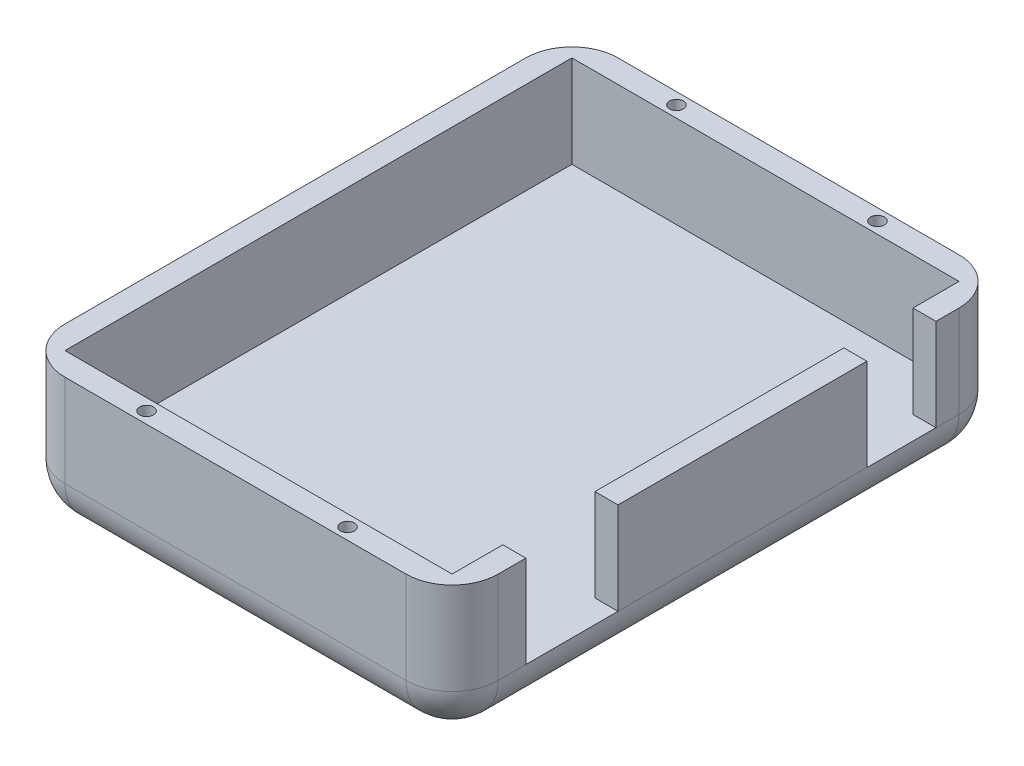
ISO-10303-21;
HEADER;
FILE_DESCRIPTION(('STEP AP214'),'2;1');
FILE_NAME('part.step','',(''),(''),'','','');
FILE_SCHEMA(('AUTOMOTIVE_DESIGN { 1 0 10303 214 1 1 1 1 }'));
ENDSEC;
DATA;
#1=APPLICATION_CONTEXT('core data for automotive mechanical design processes');
#2=APPLICATION_PROTOCOL_DEFINITION('international standard','automotive_design',2000,#1);
#3=PRODUCT_CONTEXT('',#1,'mechanical');
#4=PRODUCT('Part','Part','',(#3));
#5=PRODUCT_RELATED_PRODUCT_CATEGORY('part','',(#4));
#6=PRODUCT_DEFINITION_FORMATION('','',#4);
#7=PRODUCT_DEFINITION_CONTEXT('part definition',#1,'design');
#8=PRODUCT_DEFINITION('design','',#6,#7);
#9=PRODUCT_DEFINITION_SHAPE('','',#8);
#10=(LENGTH_UNIT() NAMED_UNIT(*) SI_UNIT(.MILLI.,.METRE.));
#11=(NAMED_UNIT(*) PLANE_ANGLE_UNIT() SI_UNIT($,.RADIAN.));
#12=(NAMED_UNIT(*) SI_UNIT($,.STERADIAN.) SOLID_ANGLE_UNIT());
#13=UNCERTAINTY_MEASURE_WITH_UNIT(LENGTH_MEASURE(1.E-05),#10,'distance_accuracy_value','');
#14=(GEOMETRIC_REPRESENTATION_CONTEXT(3) GLOBAL_UNCERTAINTY_ASSIGNED_CONTEXT((#13)) GLOBAL_UNIT_ASSIGNED_CONTEXT((#10,
#11,#12)) REPRESENTATION_CONTEXT('',''));
#15=CARTESIAN_POINT('',(0.,0.,0.));
#16=DIRECTION('',(0.,0.,1.));
#17=DIRECTION('',(1.,0.,0.));
#18=AXIS2_PLACEMENT_3D('',#15,#16,#17);
#19=CARTESIAN_POINT('',(0.,30.,120.));
#20=DIRECTION('',(0.,1.,0.));
#21=DIRECTION('',(0.,0.,1.));
#22=AXIS2_PLACEMENT_3D('',#19,#20,#21);
#23=PLANE('',#22);
#24=CARTESIAN_POINT('',(68.8071891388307,30.,117.5));
#25=DIRECTION('',(0.,-1.,0.));
#26=DIRECTION('',(0.,0.,-1.));
#27=AXIS2_PLACEMENT_3D('',#24,#25,#26);
#28=CIRCLE('',#27,1.5);
#29=CARTESIAN_POINT('',(68.8071891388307,30.,116.));
#30=VERTEX_POINT('',#29);
#31=EDGE_CURVE('E947',#30,#30,#28,.T.);
#32=ORIENTED_EDGE('',*,*,#31,.T.);
#33=EDGE_LOOP('',(#32));
#34=FACE_BOUND('',#33,.T.);
#35=CARTESIAN_POINT('',(68.8071891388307,30.,2.50000000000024));
#36=DIRECTION('',(0.,-1.,0.));
#37=DIRECTION('',(0.,0.,-1.));
#38=AXIS2_PLACEMENT_3D('',#35,#36,#37);
#39=CIRCLE('',#38,1.5);
#40=CARTESIAN_POINT('',(68.8071891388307,30.,1.00000000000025));
#41=VERTEX_POINT('',#40);
#42=EDGE_CURVE('E957',#41,#41,#39,.T.);
#43=ORIENTED_EDGE('',*,*,#42,.T.);
#44=EDGE_LOOP('',(#43));
#45=FACE_BOUND('',#44,.T.);
#46=CARTESIAN_POINT('',(25.1928108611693,30.,2.5));
#47=DIRECTION('',(0.,1.,0.));
#48=DIRECTION('',(0.,0.,1.));
#49=AXIS2_PLACEMENT_3D('',#46,#47,#48);
#50=CIRCLE('',#49,1.5);
#51=CARTESIAN_POINT('',(25.1928108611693,30.,4.));
#52=VERTEX_POINT('',#51);
#53=EDGE_CURVE('E950',#52,#52,#50,.T.);
#54=ORIENTED_EDGE('',*,*,#53,.F.);
#55=EDGE_LOOP('',(#54));
#56=FACE_BOUND('',#55,.T.);
#57=DIRECTION('',(0.,0.,-1.));
#58=VECTOR('',#57,1.);
#59=CARTESIAN_POINT('',(0.,30.,120.));
#60=LINE('',#59,#58);
#61=CARTESIAN_POINT('',(0.,30.,110.));
#62=VERTEX_POINT('',#61);
#63=CARTESIAN_POINT('',(0.,30.,9.99999999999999));
#64=VERTEX_POINT('',#63);
#65=EDGE_CURVE('E334',#62,#64,#60,.T.);
#66=ORIENTED_EDGE('',*,*,#65,.F.);
#67=CARTESIAN_POINT('',(10.,30.,110.));
#68=DIRECTION('',(0.,1.,0.));
#69=DIRECTION('',(0.,0.,1.));
#70=AXIS2_PLACEMENT_3D('',#67,#68,#69);
#71=CIRCLE('',#70,10.);
#72=CARTESIAN_POINT('',(10.,30.,120.));
#73=VERTEX_POINT('',#72);
#74=EDGE_CURVE('E361',#62,#73,#71,.T.);
#75=ORIENTED_EDGE('',*,*,#74,.T.);
#76=DIRECTION('',(1.,0.,0.));
#77=VECTOR('',#76,1.);
#78=CARTESIAN_POINT('',(0.,30.,120.));
#79=LINE('',#78,#77);
#80=CARTESIAN_POINT('',(84.,30.,120.));
#81=VERTEX_POINT('',#80);
#82=EDGE_CURVE('E331',#73,#81,#79,.T.);
#83=ORIENTED_EDGE('',*,*,#82,.T.);
#84=CARTESIAN_POINT('',(84.,30.,110.));
#85=DIRECTION('',(0.,1.,0.));
#86=DIRECTION('',(0.,0.,1.));
#87=AXIS2_PLACEMENT_3D('',#84,#85,#86);
#88=CIRCLE('',#87,10.);
#89=CARTESIAN_POINT('',(94.,30.,110.));
#90=VERTEX_POINT('',#89);
#91=EDGE_CURVE('E359',#81,#90,#88,.T.);
#92=ORIENTED_EDGE('',*,*,#91,.T.);
#93=DIRECTION('',(0.,0.,-1.));
#94=VECTOR('',#93,1.);
#95=CARTESIAN_POINT('',(94.,30.,120.));
#96=LINE('',#95,#94);
#97=CARTESIAN_POINT('',(94.,30.,104.));
#98=VERTEX_POINT('',#97);
#99=EDGE_CURVE('E337',#90,#98,#96,.T.);
#100=ORIENTED_EDGE('',*,*,#99,.T.);
#101=DIRECTION('',(1.,0.,0.));
#102=VECTOR('',#101,1.);
#103=CARTESIAN_POINT('',(89.,30.,104.));
#104=LINE('',#103,#102);
#105=CARTESIAN_POINT('',(89.,30.,104.));
#106=VERTEX_POINT('',#105);
#107=EDGE_CURVE('E271',#106,#98,#104,.T.);
#108=ORIENTED_EDGE('',*,*,#107,.F.);
#109=DIRECTION('',(0.,0.,-1.));
#110=VECTOR('',#109,1.);
#111=CARTESIAN_POINT('',(89.,30.,115.));
#112=LINE('',#111,#110);
#113=CARTESIAN_POINT('',(89.,30.,115.));
#114=VERTEX_POINT('',#113);
#115=EDGE_CURVE('E314',#114,#106,#112,.T.);
#116=ORIENTED_EDGE('',*,*,#115,.F.);
#117=DIRECTION('',(1.,0.,0.));
#118=VECTOR('',#117,1.);
#119=CARTESIAN_POINT('',(5.,30.,115.));
#120=LINE('',#119,#118);
#121=CARTESIAN_POINT('',(5.,30.,115.));
#122=VERTEX_POINT('',#121);
#123=EDGE_CURVE('E296',#122,#114,#120,.T.);
#124=ORIENTED_EDGE('',*,*,#123,.F.);
#125=DIRECTION('',(0.,0.,-1.));
#126=VECTOR('',#125,1.);
#127=CARTESIAN_POINT('',(5.,30.,115.));
#128=LINE('',#127,#126);
#129=CARTESIAN_POINT('',(4.99999999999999,30.,5.));
#130=VERTEX_POINT('',#129);
#131=EDGE_CURVE('E291',#122,#130,#128,.T.);
#132=ORIENTED_EDGE('',*,*,#131,.T.);
#133=DIRECTION('',(1.,0.,0.));
#134=VECTOR('',#133,1.);
#135=CARTESIAN_POINT('',(4.99999999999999,30.,5.));
#136=LINE('',#135,#134);
#137=CARTESIAN_POINT('',(89.,30.,5.));
#138=VERTEX_POINT('',#137);
#139=EDGE_CURVE('E310',#130,#138,#136,.T.);
#140=ORIENTED_EDGE('',*,*,#139,.T.);
#141=CARTESIAN_POINT('',(89.,30.,15.));
#142=VERTEX_POINT('',#141);
#143=EDGE_CURVE('E313',#142,#138,#112,.T.);
#144=ORIENTED_EDGE('',*,*,#143,.F.);
#145=DIRECTION('',(-1.,0.,0.));
#146=VECTOR('',#145,1.);
#147=CARTESIAN_POINT('',(89.,30.,15.));
#148=LINE('',#147,#146);
#149=CARTESIAN_POINT('',(94.,30.,15.));
#150=VERTEX_POINT('',#149);
#151=EDGE_CURVE('E248',#150,#142,#148,.T.);
#152=ORIENTED_EDGE('',*,*,#151,.F.);
#153=CARTESIAN_POINT('',(94.,30.,9.99999999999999));
#154=VERTEX_POINT('',#153);
#155=EDGE_CURVE('E341',#150,#154,#96,.T.);
#156=ORIENTED_EDGE('',*,*,#155,.T.);
#157=CARTESIAN_POINT('',(84.,30.,10.));
#158=DIRECTION('',(0.,1.,0.));
#159=DIRECTION('',(0.,0.,1.));
#160=AXIS2_PLACEMENT_3D('',#157,#158,#159);
#161=CIRCLE('',#160,10.);
#162=CARTESIAN_POINT('',(84.,30.,0.));
#163=VERTEX_POINT('',#162);
#164=EDGE_CURVE('E357',#154,#163,#161,.T.);
#165=ORIENTED_EDGE('',*,*,#164,.T.);
#166=DIRECTION('',(1.,0.,0.));
#167=VECTOR('',#166,1.);
#168=CARTESIAN_POINT('',(0.,30.,0.));
#169=LINE('',#168,#167);
#170=CARTESIAN_POINT('',(10.,30.,0.));
#171=VERTEX_POINT('',#170);
#172=EDGE_CURVE('E330',#171,#163,#169,.T.);
#173=ORIENTED_EDGE('',*,*,#172,.F.);
#174=CARTESIAN_POINT('',(10.,30.,10.));
#175=DIRECTION('',(0.,1.,0.));
#176=DIRECTION('',(0.,0.,1.));
#177=AXIS2_PLACEMENT_3D('',#174,#175,#176);
#178=CIRCLE('',#177,10.);
#179=EDGE_CURVE('E349',#171,#64,#178,.T.);
#180=ORIENTED_EDGE('',*,*,#179,.T.);
#181=EDGE_LOOP('',(#66,#75,#83,#92,#100,#108,#116,#124,#132,#140,#144,#152,#156,#165,#173,#180));
#182=FACE_BOUND('',#181,.T.);
#183=CARTESIAN_POINT('',(25.1928108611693,30.,117.5));
#184=DIRECTION('',(0.,1.,0.));
#185=DIRECTION('',(0.,0.,1.));
#186=AXIS2_PLACEMENT_3D('',#183,#184,#185);
#187=CIRCLE('',#186,1.5);
#188=CARTESIAN_POINT('',(25.1928108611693,30.,119.));
#189=VERTEX_POINT('',#188);
#190=EDGE_CURVE('E946',#189,#189,#187,.T.);
#191=ORIENTED_EDGE('',*,*,#190,.F.);
#192=EDGE_LOOP('',(#191));
#193=FACE_BOUND('',#192,.T.);
#194=ADVANCED_FACE('F35',(#34,#45,#56,#182,#193),#23,.T.);
#195=CARTESIAN_POINT('',(94.,30.,120.));
#196=DIRECTION('',(1.,0.,0.));
#197=DIRECTION('',(0.,0.,-1.));
#198=AXIS2_PLACEMENT_3D('',#195,#196,#197);
#199=PLANE('',#198);
#200=DIRECTION('',(0.,-1.,0.));
#201=VECTOR('',#200,1.);
#202=CARTESIAN_POINT('',(94.,0.,110.));
#203=LINE('',#202,#201);
#204=CARTESIAN_POINT('',(94.,10.,110.));
#205=VERTEX_POINT('',#204);
#206=EDGE_CURVE('E370',#90,#205,#203,.T.);
#207=ORIENTED_EDGE('',*,*,#206,.T.);
#208=DIRECTION('',(0.,0.,-1.));
#209=VECTOR('',#208,1.);
#210=CARTESIAN_POINT('',(94.,10.,9.99999999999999));
#211=LINE('',#210,#209);
#212=CARTESIAN_POINT('',(94.,10.,104.));
#213=VERTEX_POINT('',#212);
#214=EDGE_CURVE('E398',#205,#213,#211,.T.);
#215=ORIENTED_EDGE('',*,*,#214,.T.);
#216=DIRECTION('',(0.,-1.,0.));
#217=VECTOR('',#216,1.);
#218=CARTESIAN_POINT('',(94.,30.,104.));
#219=LINE('',#218,#217);
#220=EDGE_CURVE('E285',#98,#213,#219,.T.);
#221=ORIENTED_EDGE('',*,*,#220,.F.);
#222=ORIENTED_EDGE('',*,*,#99,.F.);
#223=EDGE_LOOP('',(#207,#215,#221,#222));
#224=FACE_BOUND('',#223,.T.);
#225=ADVANCED_FACE('F439',(#224),#199,.T.);
#226=DIRECTION('',(0.,-1.,0.));
#227=VECTOR('',#226,1.);
#228=CARTESIAN_POINT('',(94.,30.,84.));
#229=LINE('',#228,#227);
#230=CARTESIAN_POINT('',(94.,30.,84.));
#231=VERTEX_POINT('',#230);
#232=CARTESIAN_POINT('',(94.,10.,84.));
#233=VERTEX_POINT('',#232);
#234=EDGE_CURVE('E288',#231,#233,#229,.T.);
#235=ORIENTED_EDGE('',*,*,#234,.T.);
#236=DIRECTION('',(0.,0.,-1.));
#237=VECTOR('',#236,1.);
#238=CARTESIAN_POINT('',(94.,10.,9.99999999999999));
#239=LINE('',#238,#237);
#240=CARTESIAN_POINT('',(94.,10.,30.));
#241=VERTEX_POINT('',#240);
#242=EDGE_CURVE('E396',#233,#241,#239,.T.);
#243=ORIENTED_EDGE('',*,*,#242,.T.);
#244=DIRECTION('',(0.,-1.,0.));
#245=VECTOR('',#244,1.);
#246=CARTESIAN_POINT('',(94.,30.,30.));
#247=LINE('',#246,#245);
#248=CARTESIAN_POINT('',(94.,30.,30.));
#249=VERTEX_POINT('',#248);
#250=EDGE_CURVE('E257',#249,#241,#247,.T.);
#251=ORIENTED_EDGE('',*,*,#250,.F.);
#252=EDGE_CURVE('E340',#231,#249,#96,.T.);
#253=ORIENTED_EDGE('',*,*,#252,.F.);
#254=EDGE_LOOP('',(#235,#243,#251,#253));
#255=FACE_BOUND('',#254,.T.);
#256=ADVANCED_FACE('F487',(#255),#199,.T.);
#257=CARTESIAN_POINT('',(34.,-26.,42.8830656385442));
#258=DIRECTION('',(-1.,0.,0.));
#259=DIRECTION('',(0.,0.,1.));
#260=AXIS2_PLACEMENT_3D('',#257,#258,#259);
#261=PLANE('',#260);
#262=DIRECTION('',(0.,1.,0.));
#263=VECTOR('',#262,1.);
#264=CARTESIAN_POINT('',(34.,-26.,42.8830656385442));
#265=LINE('',#264,#263);
#266=CARTESIAN_POINT('',(34.,-13.,42.8830656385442));
#267=VERTEX_POINT('',#266);
#268=CARTESIAN_POINT('',(34.,0.,42.8830656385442));
#269=VERTEX_POINT('',#268);
#270=EDGE_CURVE('E227',#267,#269,#265,.T.);
#271=ORIENTED_EDGE('',*,*,#270,.F.);
#272=DIRECTION('',(0.,0.,-1.));
#273=VECTOR('',#272,1.);
#274=CARTESIAN_POINT('',(34.,-13.,120.));
#275=LINE('',#274,#273);
#276=CARTESIAN_POINT('',(34.,-13.,76.8830656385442));
#277=VERTEX_POINT('',#276);
#278=EDGE_CURVE('E213',#277,#267,#275,.T.);
#279=ORIENTED_EDGE('',*,*,#278,.F.);
#280=DIRECTION('',(0.,1.,0.));
#281=VECTOR('',#280,1.);
#282=CARTESIAN_POINT('',(34.,-26.,76.8830656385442));
#283=LINE('',#282,#281);
#284=CARTESIAN_POINT('',(34.,0.,76.8830656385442));
#285=VERTEX_POINT('',#284);
#286=EDGE_CURVE('E225',#277,#285,#283,.T.);
#287=ORIENTED_EDGE('',*,*,#286,.T.);
#288=DIRECTION('',(0.,0.,1.));
#289=VECTOR('',#288,1.);
#290=CARTESIAN_POINT('',(34.,0.,42.8830656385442));
#291=LINE('',#290,#289);
#292=EDGE_CURVE('E238',#269,#285,#291,.T.);
#293=ORIENTED_EDGE('',*,*,#292,.F.);
#294=EDGE_LOOP('',(#271,#279,#287,#293));
#295=FACE_BOUND('',#294,.T.);
#296=ADVANCED_FACE('F223',(#295),#261,.T.);
#297=CARTESIAN_POINT('',(0.,0.,120.));
#298=DIRECTION('',(0.,1.,0.));
#299=DIRECTION('',(0.,0.,1.));
#300=AXIS2_PLACEMENT_3D('',#297,#298,#299);
#301=PLANE('',#300);
#302=DIRECTION('',(1.,0.,0.));
#303=VECTOR('',#302,1.);
#304=CARTESIAN_POINT('',(0.,0.,110.));
#305=LINE('',#304,#303);
#306=CARTESIAN_POINT('',(84.,0.,110.));
#307=VERTEX_POINT('',#306);
#308=CARTESIAN_POINT('',(10.,0.,110.));
#309=VERTEX_POINT('',#308);
#310=EDGE_CURVE('E382',#307,#309,#305,.F.);
#311=ORIENTED_EDGE('',*,*,#310,.T.);
#312=DIRECTION('',(0.,0.,-1.));
#313=VECTOR('',#312,1.);
#314=CARTESIAN_POINT('',(10.,0.,9.99999999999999));
#315=LINE('',#314,#313);
#316=CARTESIAN_POINT('',(10.,0.,9.99999999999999));
#317=VERTEX_POINT('',#316);
#318=EDGE_CURVE('E384',#309,#317,#315,.T.);
#319=ORIENTED_EDGE('',*,*,#318,.T.);
#320=DIRECTION('',(1.,0.,0.));
#321=VECTOR('',#320,1.);
#322=CARTESIAN_POINT('',(84.,0.,9.99999999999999));
#323=LINE('',#322,#321);
#324=CARTESIAN_POINT('',(84.,0.,9.99999999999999));
#325=VERTEX_POINT('',#324);
#326=EDGE_CURVE('E378',#317,#325,#323,.T.);
#327=ORIENTED_EDGE('',*,*,#326,.T.);
#328=DIRECTION('',(0.,0.,-1.));
#329=VECTOR('',#328,1.);
#330=CARTESIAN_POINT('',(84.,0.,110.));
#331=LINE('',#330,#329);
#332=EDGE_CURVE('E380',#325,#307,#331,.F.);
#333=ORIENTED_EDGE('',*,*,#332,.T.);
#334=EDGE_LOOP('',(#311,#319,#327,#333));
#335=FACE_BOUND('',#334,.T.);
#336=DIRECTION('',(1.,0.,0.));
#337=VECTOR('',#336,1.);
#338=CARTESIAN_POINT('',(34.,0.,42.8830656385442));
#339=LINE('',#338,#337);
#340=CARTESIAN_POINT('',(60.,0.,42.8830656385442));
#341=VERTEX_POINT('',#340);
#342=EDGE_CURVE('E346',#269,#341,#339,.T.);
#343=ORIENTED_EDGE('',*,*,#342,.F.);
#344=ORIENTED_EDGE('',*,*,#292,.T.);
#345=DIRECTION('',(1.,0.,0.));
#346=VECTOR('',#345,1.);
#347=CARTESIAN_POINT('',(34.,0.,76.8830656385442));
#348=LINE('',#347,#346);
#349=CARTESIAN_POINT('',(60.,0.,76.8830656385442));
#350=VERTEX_POINT('',#349);
#351=EDGE_CURVE('E232',#285,#350,#348,.T.);
#352=ORIENTED_EDGE('',*,*,#351,.T.);
#353=DIRECTION('',(0.,0.,-1.));
#354=VECTOR('',#353,1.);
#355=CARTESIAN_POINT('',(60.,0.,76.8830656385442));
#356=LINE('',#355,#354);
#357=EDGE_CURVE('E973',#350,#341,#356,.T.);
#358=ORIENTED_EDGE('',*,*,#357,.T.);
#359=EDGE_LOOP('',(#343,#344,#352,#358));
#360=FACE_BOUND('',#359,.T.);
#361=ADVANCED_FACE('F560',(#335,#360),#301,.F.);
#362=CARTESIAN_POINT('',(89.,10.,115.));
#363=DIRECTION('',(1.,0.,0.));
#364=DIRECTION('',(0.,0.,-1.));
#365=AXIS2_PLACEMENT_3D('',#362,#363,#364);
#366=PLANE('',#365);
#367=DIRECTION('',(0.,0.,-1.));
#368=VECTOR('',#367,1.);
#369=CARTESIAN_POINT('',(89.,10.,115.));
#370=LINE('',#369,#368);
#371=CARTESIAN_POINT('',(89.,10.,15.));
#372=VERTEX_POINT('',#371);
#373=CARTESIAN_POINT('',(89.,10.,5.));
#374=VERTEX_POINT('',#373);
#375=EDGE_CURVE('E299',#372,#374,#370,.T.);
#376=ORIENTED_EDGE('',*,*,#375,.F.);
#377=DIRECTION('',(0.,1.,0.));
#378=VECTOR('',#377,1.);
#379=CARTESIAN_POINT('',(89.,10.,15.));
#380=LINE('',#379,#378);
#381=EDGE_CURVE('E254',#372,#142,#380,.T.);
#382=ORIENTED_EDGE('',*,*,#381,.T.);
#383=ORIENTED_EDGE('',*,*,#143,.T.);
#384=DIRECTION('',(0.,1.,0.));
#385=VECTOR('',#384,1.);
#386=CARTESIAN_POINT('',(89.,10.,5.));
#387=LINE('',#386,#385);
#388=EDGE_CURVE('E324',#374,#138,#387,.T.);
#389=ORIENTED_EDGE('',*,*,#388,.F.);
#390=EDGE_LOOP('',(#376,#382,#383,#389));
#391=FACE_BOUND('',#390,.T.);
#392=ADVANCED_FACE('F469',(#391),#366,.F.);
#393=DIRECTION('',(1.,0.,0.));
#394=VECTOR('',#393,1.);
#395=CARTESIAN_POINT('',(89.,30.,30.));
#396=LINE('',#395,#394);
#397=CARTESIAN_POINT('',(89.,30.,30.));
#398=VERTEX_POINT('',#397);
#399=EDGE_CURVE('E243',#398,#249,#396,.T.);
#400=ORIENTED_EDGE('',*,*,#399,.F.);
#401=CARTESIAN_POINT('',(89.,30.,84.));
#402=VERTEX_POINT('',#401);
#403=EDGE_CURVE('E317',#402,#398,#112,.T.);
#404=ORIENTED_EDGE('',*,*,#403,.F.);
#405=DIRECTION('',(1.,0.,0.));
#406=VECTOR('',#405,1.);
#407=CARTESIAN_POINT('',(89.,30.,84.));
#408=LINE('',#407,#406);
#409=EDGE_CURVE('E266',#402,#231,#408,.T.);
#410=ORIENTED_EDGE('',*,*,#409,.T.);
#411=ORIENTED_EDGE('',*,*,#252,.T.);
#412=EDGE_LOOP('',(#400,#404,#410,#411));
#413=FACE_BOUND('',#412,.T.);
#414=ADVANCED_FACE('F480',(#413),#23,.T.);
#415=DIRECTION('',(0.,1.,0.));
#416=VECTOR('',#415,1.);
#417=CARTESIAN_POINT('',(94.,30.,15.));
#418=LINE('',#417,#416);
#419=CARTESIAN_POINT('',(94.,10.,15.));
#420=VERTEX_POINT('',#419);
#421=EDGE_CURVE('E261',#420,#150,#418,.T.);
#422=ORIENTED_EDGE('',*,*,#421,.F.);
#423=DIRECTION('',(0.,0.,-1.));
#424=VECTOR('',#423,1.);
#425=CARTESIAN_POINT('',(94.,10.,9.99999999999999));
#426=LINE('',#425,#424);
#427=CARTESIAN_POINT('',(94.,10.,9.99999999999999));
#428=VERTEX_POINT('',#427);
#429=EDGE_CURVE('E59',#420,#428,#426,.T.);
#430=ORIENTED_EDGE('',*,*,#429,.T.);
#431=DIRECTION('',(0.,-1.,0.));
#432=VECTOR('',#431,1.);
#433=CARTESIAN_POINT('',(94.,30.,9.99999999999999));
#434=LINE('',#433,#432);
#435=EDGE_CURVE('E368',#428,#154,#434,.F.);
#436=ORIENTED_EDGE('',*,*,#435,.T.);
#437=ORIENTED_EDGE('',*,*,#155,.F.);
#438=EDGE_LOOP('',(#422,#430,#436,#437));
#439=FACE_BOUND('',#438,.T.);
#440=ADVANCED_FACE('F495',(#439),#199,.T.);
#441=ORIENTED_EDGE('',*,*,#403,.T.);
#442=DIRECTION('',(0.,1.,0.));
#443=VECTOR('',#442,1.);
#444=CARTESIAN_POINT('',(89.,10.,30.));
#445=LINE('',#444,#443);
#446=CARTESIAN_POINT('',(89.,10.,30.));
#447=VERTEX_POINT('',#446);
#448=EDGE_CURVE('E251',#447,#398,#445,.T.);
#449=ORIENTED_EDGE('',*,*,#448,.F.);
#450=CARTESIAN_POINT('',(89.,10.,84.));
#451=VERTEX_POINT('',#450);
#452=EDGE_CURVE('E304',#451,#447,#370,.T.);
#453=ORIENTED_EDGE('',*,*,#452,.F.);
#454=DIRECTION('',(0.,1.,0.));
#455=VECTOR('',#454,1.);
#456=CARTESIAN_POINT('',(89.,10.,84.));
#457=LINE('',#456,#455);
#458=EDGE_CURVE('E280',#451,#402,#457,.T.);
#459=ORIENTED_EDGE('',*,*,#458,.T.);
#460=EDGE_LOOP('',(#441,#449,#453,#459));
#461=FACE_BOUND('',#460,.T.);
#462=ADVANCED_FACE('F475',(#461),#366,.F.);
#463=CARTESIAN_POINT('',(0.,0.,120.));
#464=DIRECTION('',(-1.,0.,0.));
#465=DIRECTION('',(0.,0.,1.));
#466=AXIS2_PLACEMENT_3D('',#463,#464,#465);
#467=PLANE('',#466);
#468=DIRECTION('',(0.,1.,0.));
#469=VECTOR('',#468,1.);
#470=CARTESIAN_POINT('',(0.,0.,9.99999999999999));
#471=LINE('',#470,#469);
#472=CARTESIAN_POINT('',(0.,10.,9.99999999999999));
#473=VERTEX_POINT('',#472);
#474=EDGE_CURVE('E352',#64,#473,#471,.F.);
#475=ORIENTED_EDGE('',*,*,#474,.T.);
#476=DIRECTION('',(0.,0.,-1.));
#477=VECTOR('',#476,1.);
#478=CARTESIAN_POINT('',(0.,10.,110.));
#479=LINE('',#478,#477);
#480=CARTESIAN_POINT('',(0.,10.,110.));
#481=VERTEX_POINT('',#480);
#482=EDGE_CURVE('E387',#473,#481,#479,.F.);
#483=ORIENTED_EDGE('',*,*,#482,.T.);
#484=DIRECTION('',(0.,1.,0.));
#485=VECTOR('',#484,1.);
#486=CARTESIAN_POINT('',(0.,30.,110.));
#487=LINE('',#486,#485);
#488=EDGE_CURVE('E355',#481,#62,#487,.T.);
#489=ORIENTED_EDGE('',*,*,#488,.T.);
#490=ORIENTED_EDGE('',*,*,#65,.T.);
#491=EDGE_LOOP('',(#475,#483,#489,#490));
#492=FACE_BOUND('',#491,.T.);
#493=ADVANCED_FACE('F526',(#492),#467,.T.);
#494=CARTESIAN_POINT('',(0.,0.,120.));
#495=DIRECTION('',(0.,0.,-1.));
#496=DIRECTION('',(-1.,0.,0.));
#497=AXIS2_PLACEMENT_3D('',#494,#495,#496);
#498=PLANE('',#497);
#499=DIRECTION('',(0.,1.,0.));
#500=VECTOR('',#499,1.);
#501=CARTESIAN_POINT('',(10.,0.,120.));
#502=LINE('',#501,#500);
#503=CARTESIAN_POINT('',(10.,10.,120.));
#504=VERTEX_POINT('',#503);
#505=EDGE_CURVE('E365',#73,#504,#502,.F.);
#506=ORIENTED_EDGE('',*,*,#505,.T.);
#507=DIRECTION('',(1.,0.,0.));
#508=VECTOR('',#507,1.);
#509=CARTESIAN_POINT('',(0.,10.,120.));
#510=LINE('',#509,#508);
#511=CARTESIAN_POINT('',(84.,10.,120.));
#512=VERTEX_POINT('',#511);
#513=EDGE_CURVE('E391',#504,#512,#510,.T.);
#514=ORIENTED_EDGE('',*,*,#513,.T.);
#515=DIRECTION('',(0.,-1.,0.));
#516=VECTOR('',#515,1.);
#517=CARTESIAN_POINT('',(84.,30.,120.));
#518=LINE('',#517,#516);
#519=EDGE_CURVE('E363',#512,#81,#518,.F.);
#520=ORIENTED_EDGE('',*,*,#519,.T.);
#521=ORIENTED_EDGE('',*,*,#82,.F.);
#522=EDGE_LOOP('',(#506,#514,#520,#521));
#523=FACE_BOUND('',#522,.T.);
#524=ADVANCED_FACE('F532',(#523),#498,.F.);
#525=CARTESIAN_POINT('',(0.,0.,0.));
#526=DIRECTION('',(0.,0.,-1.));
#527=DIRECTION('',(-1.,0.,0.));
#528=AXIS2_PLACEMENT_3D('',#525,#526,#527);
#529=PLANE('',#528);
#530=DIRECTION('',(0.,-1.,0.));
#531=VECTOR('',#530,1.);
#532=CARTESIAN_POINT('',(84.,0.,0.));
#533=LINE('',#532,#531);
#534=CARTESIAN_POINT('',(84.,10.,0.));
#535=VERTEX_POINT('',#534);
#536=EDGE_CURVE('E373',#163,#535,#533,.T.);
#537=ORIENTED_EDGE('',*,*,#536,.T.);
#538=DIRECTION('',(1.,0.,0.));
#539=VECTOR('',#538,1.);
#540=CARTESIAN_POINT('',(10.,10.,0.));
#541=LINE('',#540,#539);
#542=CARTESIAN_POINT('',(10.,10.,0.));
#543=VERTEX_POINT('',#542);
#544=EDGE_CURVE('E11',#535,#543,#541,.F.);
#545=ORIENTED_EDGE('',*,*,#544,.T.);
#546=DIRECTION('',(0.,1.,0.));
#547=VECTOR('',#546,1.);
#548=CARTESIAN_POINT('',(10.,0.,0.));
#549=LINE('',#548,#547);
#550=EDGE_CURVE('E339',#543,#171,#549,.T.);
#551=ORIENTED_EDGE('',*,*,#550,.T.);
#552=ORIENTED_EDGE('',*,*,#172,.T.);
#553=EDGE_LOOP('',(#537,#545,#551,#552));
#554=FACE_BOUND('',#553,.T.);
#555=ADVANCED_FACE('F502',(#554),#529,.T.);
#556=CARTESIAN_POINT('',(5.,10.,115.));
#557=DIRECTION('',(1.,0.,0.));
#558=DIRECTION('',(0.,0.,-1.));
#559=AXIS2_PLACEMENT_3D('',#556,#557,#558);
#560=PLANE('',#559);
#561=ORIENTED_EDGE('',*,*,#131,.F.);
#562=DIRECTION('',(0.,1.,0.));
#563=VECTOR('',#562,1.);
#564=CARTESIAN_POINT('',(5.,10.,115.));
#565=LINE('',#564,#563);
#566=CARTESIAN_POINT('',(5.,10.,115.));
#567=VERTEX_POINT('',#566);
#568=EDGE_CURVE('E307',#567,#122,#565,.T.);
#569=ORIENTED_EDGE('',*,*,#568,.F.);
#570=DIRECTION('',(0.,0.,-1.));
#571=VECTOR('',#570,1.);
#572=CARTESIAN_POINT('',(5.,10.,115.));
#573=LINE('',#572,#571);
#574=CARTESIAN_POINT('',(4.99999999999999,10.,5.));
#575=VERTEX_POINT('',#574);
#576=EDGE_CURVE('E292',#567,#575,#573,.T.);
#577=ORIENTED_EDGE('',*,*,#576,.T.);
#578=DIRECTION('',(0.,1.,0.));
#579=VECTOR('',#578,1.);
#580=CARTESIAN_POINT('',(4.99999999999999,10.,5.));
#581=LINE('',#580,#579);
#582=EDGE_CURVE('E327',#575,#130,#581,.T.);
#583=ORIENTED_EDGE('',*,*,#582,.T.);
#584=EDGE_LOOP('',(#561,#569,#577,#583));
#585=FACE_BOUND('',#584,.T.);
#586=ADVANCED_FACE('F462',(#585),#560,.T.);
#587=CARTESIAN_POINT('',(4.99999999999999,10.,5.));
#588=DIRECTION('',(0.,0.,1.));
#589=DIRECTION('',(1.,0.,0.));
#590=AXIS2_PLACEMENT_3D('',#587,#588,#589);
#591=PLANE('',#590);
#592=ORIENTED_EDGE('',*,*,#139,.F.);
#593=ORIENTED_EDGE('',*,*,#582,.F.);
#594=DIRECTION('',(1.,0.,0.));
#595=VECTOR('',#594,1.);
#596=CARTESIAN_POINT('',(4.99999999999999,10.,5.));
#597=LINE('',#596,#595);
#598=EDGE_CURVE('E295',#575,#374,#597,.T.);
#599=ORIENTED_EDGE('',*,*,#598,.T.);
#600=ORIENTED_EDGE('',*,*,#388,.T.);
#601=EDGE_LOOP('',(#592,#593,#599,#600));
#602=FACE_BOUND('',#601,.T.);
#603=ADVANCED_FACE('F465',(#602),#591,.T.);
#604=ORIENTED_EDGE('',*,*,#115,.T.);
#605=DIRECTION('',(0.,1.,0.));
#606=VECTOR('',#605,1.);
#607=CARTESIAN_POINT('',(89.,10.,104.));
#608=LINE('',#607,#606);
#609=CARTESIAN_POINT('',(89.,10.,104.));
#610=VERTEX_POINT('',#609);
#611=EDGE_CURVE('E274',#610,#106,#608,.T.);
#612=ORIENTED_EDGE('',*,*,#611,.F.);
#613=CARTESIAN_POINT('',(89.,10.,115.));
#614=VERTEX_POINT('',#613);
#615=EDGE_CURVE('E300',#614,#610,#370,.T.);
#616=ORIENTED_EDGE('',*,*,#615,.F.);
#617=DIRECTION('',(0.,1.,0.));
#618=VECTOR('',#617,1.);
#619=CARTESIAN_POINT('',(89.,10.,115.));
#620=LINE('',#619,#618);
#621=EDGE_CURVE('E322',#614,#114,#620,.T.);
#622=ORIENTED_EDGE('',*,*,#621,.T.);
#623=EDGE_LOOP('',(#604,#612,#616,#622));
#624=FACE_BOUND('',#623,.T.);
#625=ADVANCED_FACE('F451',(#624),#366,.F.);
#626=CARTESIAN_POINT('',(5.,10.,115.));
#627=DIRECTION('',(0.,0.,1.));
#628=DIRECTION('',(1.,0.,0.));
#629=AXIS2_PLACEMENT_3D('',#626,#627,#628);
#630=PLANE('',#629);
#631=ORIENTED_EDGE('',*,*,#123,.T.);
#632=ORIENTED_EDGE('',*,*,#621,.F.);
#633=DIRECTION('',(1.,0.,0.));
#634=VECTOR('',#633,1.);
#635=CARTESIAN_POINT('',(5.,10.,115.));
#636=LINE('',#635,#634);
#637=EDGE_CURVE('E303',#567,#614,#636,.T.);
#638=ORIENTED_EDGE('',*,*,#637,.F.);
#639=ORIENTED_EDGE('',*,*,#568,.T.);
#640=EDGE_LOOP('',(#631,#632,#638,#639));
#641=FACE_BOUND('',#640,.T.);
#642=ADVANCED_FACE('F458',(#641),#630,.F.);
#643=CARTESIAN_POINT('',(0.,10.,0.));
#644=DIRECTION('',(0.,-1.,0.));
#645=DIRECTION('',(0.,0.,-1.));
#646=AXIS2_PLACEMENT_3D('',#643,#644,#645);
#647=PLANE('',#646);
#648=ORIENTED_EDGE('',*,*,#576,.F.);
#649=ORIENTED_EDGE('',*,*,#637,.T.);
#650=ORIENTED_EDGE('',*,*,#615,.T.);
#651=DIRECTION('',(1.,0.,0.));
#652=VECTOR('',#651,1.);
#653=CARTESIAN_POINT('',(89.,10.,104.));
#654=LINE('',#653,#652);
#655=EDGE_CURVE('E270',#610,#213,#654,.T.);
#656=ORIENTED_EDGE('',*,*,#655,.T.);
#657=DIRECTION('',(0.,0.,-1.));
#658=VECTOR('',#657,1.);
#659=CARTESIAN_POINT('',(94.,10.,120.));
#660=LINE('',#659,#658);
#661=EDGE_CURVE('E283',#213,#233,#660,.T.);
#662=ORIENTED_EDGE('',*,*,#661,.T.);
#663=DIRECTION('',(1.,0.,0.));
#664=VECTOR('',#663,1.);
#665=CARTESIAN_POINT('',(89.,10.,84.));
#666=LINE('',#665,#664);
#667=EDGE_CURVE('E267',#451,#233,#666,.T.);
#668=ORIENTED_EDGE('',*,*,#667,.F.);
#669=ORIENTED_EDGE('',*,*,#452,.T.);
#670=DIRECTION('',(1.,0.,0.));
#671=VECTOR('',#670,1.);
#672=CARTESIAN_POINT('',(89.,10.,30.));
#673=LINE('',#672,#671);
#674=EDGE_CURVE('E244',#447,#241,#673,.T.);
#675=ORIENTED_EDGE('',*,*,#674,.T.);
#676=DIRECTION('',(0.,0.,1.));
#677=VECTOR('',#676,1.);
#678=CARTESIAN_POINT('',(94.,10.,120.));
#679=LINE('',#678,#677);
#680=EDGE_CURVE('E263',#420,#241,#679,.T.);
#681=ORIENTED_EDGE('',*,*,#680,.F.);
#682=DIRECTION('',(-1.,0.,0.));
#683=VECTOR('',#682,1.);
#684=CARTESIAN_POINT('',(89.,10.,15.));
#685=LINE('',#684,#683);
#686=EDGE_CURVE('E247',#420,#372,#685,.T.);
#687=ORIENTED_EDGE('',*,*,#686,.T.);
#688=ORIENTED_EDGE('',*,*,#375,.T.);
#689=ORIENTED_EDGE('',*,*,#598,.F.);
#690=EDGE_LOOP('',(#648,#649,#650,#656,#662,#668,#669,#675,#681,#687,#688,#689));
#691=FACE_BOUND('',#690,.T.);
#692=ADVANCED_FACE('F454',(#691),#647,.F.);
#693=CARTESIAN_POINT('',(89.,10.,84.));
#694=DIRECTION('',(0.,0.,1.));
#695=DIRECTION('',(1.,0.,0.));
#696=AXIS2_PLACEMENT_3D('',#693,#694,#695);
#697=PLANE('',#696);
#698=ORIENTED_EDGE('',*,*,#409,.F.);
#699=ORIENTED_EDGE('',*,*,#458,.F.);
#700=ORIENTED_EDGE('',*,*,#667,.T.);
#701=ORIENTED_EDGE('',*,*,#234,.F.);
#702=EDGE_LOOP('',(#698,#699,#700,#701));
#703=FACE_BOUND('',#702,.T.);
#704=ADVANCED_FACE('F918',(#703),#697,.T.);
#705=CARTESIAN_POINT('',(89.,10.,104.));
#706=DIRECTION('',(0.,0.,1.));
#707=DIRECTION('',(1.,0.,0.));
#708=AXIS2_PLACEMENT_3D('',#705,#706,#707);
#709=PLANE('',#708);
#710=ORIENTED_EDGE('',*,*,#220,.T.);
#711=ORIENTED_EDGE('',*,*,#655,.F.);
#712=ORIENTED_EDGE('',*,*,#611,.T.);
#713=ORIENTED_EDGE('',*,*,#107,.T.);
#714=EDGE_LOOP('',(#710,#711,#712,#713));
#715=FACE_BOUND('',#714,.T.);
#716=ADVANCED_FACE('F447',(#715),#709,.F.);
#717=CARTESIAN_POINT('',(89.,10.,15.));
#718=DIRECTION('',(0.,0.,-1.));
#719=DIRECTION('',(-1.,0.,0.));
#720=AXIS2_PLACEMENT_3D('',#717,#718,#719);
#721=PLANE('',#720);
#722=ORIENTED_EDGE('',*,*,#421,.T.);
#723=ORIENTED_EDGE('',*,*,#151,.T.);
#724=ORIENTED_EDGE('',*,*,#381,.F.);
#725=ORIENTED_EDGE('',*,*,#686,.F.);
#726=EDGE_LOOP('',(#722,#723,#724,#725));
#727=FACE_BOUND('',#726,.T.);
#728=ADVANCED_FACE('F493',(#727),#721,.F.);
#729=CARTESIAN_POINT('',(89.,10.,30.));
#730=DIRECTION('',(0.,0.,1.));
#731=DIRECTION('',(1.,0.,0.));
#732=AXIS2_PLACEMENT_3D('',#729,#730,#731);
#733=PLANE('',#732);
#734=ORIENTED_EDGE('',*,*,#250,.T.);
#735=ORIENTED_EDGE('',*,*,#674,.F.);
#736=ORIENTED_EDGE('',*,*,#448,.T.);
#737=ORIENTED_EDGE('',*,*,#399,.T.);
#738=EDGE_LOOP('',(#734,#735,#736,#737));
#739=FACE_BOUND('',#738,.T.);
#740=ADVANCED_FACE('F485',(#739),#733,.F.);
#741=CARTESIAN_POINT('',(34.,-26.,42.8830656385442));
#742=DIRECTION('',(0.,0.,1.));
#743=DIRECTION('',(1.,0.,0.));
#744=AXIS2_PLACEMENT_3D('',#741,#742,#743);
#745=PLANE('',#744);
#746=CARTESIAN_POINT('',(47.,-13.,42.8830656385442));
#747=DIRECTION('',(0.,0.,-1.));
#748=DIRECTION('',(-1.,0.,0.));
#749=AXIS2_PLACEMENT_3D('',#746,#747,#748);
#750=CIRCLE('',#749,11.5);
#751=CARTESIAN_POINT('',(35.5,-13.,42.8830656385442));
#752=VERTEX_POINT('',#751);
#753=EDGE_CURVE('E347',#752,#752,#750,.T.);
#754=ORIENTED_EDGE('',*,*,#753,.F.);
#755=EDGE_LOOP('',(#754));
#756=FACE_BOUND('',#755,.T.);
#757=CARTESIAN_POINT('',(47.,-13.,42.8830656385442));
#758=DIRECTION('',(0.,0.,1.));
#759=DIRECTION('',(1.,0.,0.));
#760=AXIS2_PLACEMENT_3D('',#757,#758,#759);
#761=CIRCLE('',#760,13.);
#762=CARTESIAN_POINT('',(60.,-13.,42.8830656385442));
#763=VERTEX_POINT('',#762);
#764=EDGE_CURVE('E220',#763,#267,#761,.F.);
#765=ORIENTED_EDGE('',*,*,#764,.T.);
#766=ORIENTED_EDGE('',*,*,#270,.T.);
#767=ORIENTED_EDGE('',*,*,#342,.T.);
#768=DIRECTION('',(0.,1.,0.));
#769=VECTOR('',#768,1.);
#770=CARTESIAN_POINT('',(60.,-26.,42.8830656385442));
#771=LINE('',#770,#769);
#772=EDGE_CURVE('E236',#763,#341,#771,.T.);
#773=ORIENTED_EDGE('',*,*,#772,.F.);
#774=EDGE_LOOP('',(#765,#766,#767,#773));
#775=FACE_BOUND('',#774,.T.);
#776=ADVANCED_FACE('F655',(#756,#775),#745,.F.);
#777=CARTESIAN_POINT('',(60.,-26.,76.8830656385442));
#778=DIRECTION('',(1.,0.,0.));
#779=DIRECTION('',(0.,0.,-1.));
#780=AXIS2_PLACEMENT_3D('',#777,#778,#779);
#781=PLANE('',#780);
#782=DIRECTION('',(0.,0.,-1.));
#783=VECTOR('',#782,1.);
#784=CARTESIAN_POINT('',(60.,-13.,120.));
#785=LINE('',#784,#783);
#786=CARTESIAN_POINT('',(60.,-13.,76.8830656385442));
#787=VERTEX_POINT('',#786);
#788=EDGE_CURVE('E216',#787,#763,#785,.T.);
#789=ORIENTED_EDGE('',*,*,#788,.T.);
#790=ORIENTED_EDGE('',*,*,#772,.T.);
#791=ORIENTED_EDGE('',*,*,#357,.F.);
#792=DIRECTION('',(0.,1.,0.));
#793=VECTOR('',#792,1.);
#794=CARTESIAN_POINT('',(60.,-26.,76.8830656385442));
#795=LINE('',#794,#793);
#796=EDGE_CURVE('E234',#787,#350,#795,.T.);
#797=ORIENTED_EDGE('',*,*,#796,.F.);
#798=EDGE_LOOP('',(#789,#790,#791,#797));
#799=FACE_BOUND('',#798,.T.);
#800=ADVANCED_FACE('F660',(#799),#781,.T.);
#801=CARTESIAN_POINT('',(34.,-26.,76.8830656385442));
#802=DIRECTION('',(0.,0.,1.));
#803=DIRECTION('',(1.,0.,0.));
#804=AXIS2_PLACEMENT_3D('',#801,#802,#803);
#805=PLANE('',#804);
#806=ORIENTED_EDGE('',*,*,#286,.F.);
#807=CARTESIAN_POINT('',(47.,-13.,76.8830656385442));
#808=DIRECTION('',(0.,0.,1.));
#809=DIRECTION('',(1.,0.,0.));
#810=AXIS2_PLACEMENT_3D('',#807,#808,#809);
#811=CIRCLE('',#810,13.);
#812=EDGE_CURVE('E210',#787,#277,#811,.F.);
#813=ORIENTED_EDGE('',*,*,#812,.F.);
#814=ORIENTED_EDGE('',*,*,#796,.T.);
#815=ORIENTED_EDGE('',*,*,#351,.F.);
#816=EDGE_LOOP('',(#806,#813,#814,#815));
#817=FACE_BOUND('',#816,.T.);
#818=CARTESIAN_POINT('',(47.,-13.,76.8830656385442));
#819=DIRECTION('',(0.,0.,1.));
#820=DIRECTION('',(1.,0.,0.));
#821=AXIS2_PLACEMENT_3D('',#818,#819,#820);
#822=CIRCLE('',#821,11.5);
#823=CARTESIAN_POINT('',(58.5,-13.,76.8830656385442));
#824=VERTEX_POINT('',#823);
#825=EDGE_CURVE('E343',#824,#824,#822,.T.);
#826=ORIENTED_EDGE('',*,*,#825,.F.);
#827=EDGE_LOOP('',(#826));
#828=FACE_BOUND('',#827,.T.);
#829=ADVANCED_FACE('F229',(#817,#828),#805,.T.);
#830=CARTESIAN_POINT('',(47.,-13.,120.));
#831=DIRECTION('',(0.,0.,-1.));
#832=DIRECTION('',(-1.,0.,0.));
#833=AXIS2_PLACEMENT_3D('',#830,#831,#832);
#834=CYLINDRICAL_SURFACE('',#833,11.5);
#835=ORIENTED_EDGE('',*,*,#825,.T.);
#836=EDGE_LOOP('',(#835));
#837=FACE_BOUND('',#836,.T.);
#838=ORIENTED_EDGE('',*,*,#753,.T.);
#839=EDGE_LOOP('',(#838));
#840=FACE_BOUND('',#839,.T.);
#841=ADVANCED_FACE('F632',(#837,#840),#834,.F.);
#842=CARTESIAN_POINT('',(47.,-13.,120.));
#843=DIRECTION('',(0.,0.,-1.));
#844=DIRECTION('',(-1.,0.,0.));
#845=AXIS2_PLACEMENT_3D('',#842,#843,#844);
#846=CYLINDRICAL_SURFACE('',#845,13.);
#847=ORIENTED_EDGE('',*,*,#788,.F.);
#848=ORIENTED_EDGE('',*,*,#812,.T.);
#849=ORIENTED_EDGE('',*,*,#278,.T.);
#850=ORIENTED_EDGE('',*,*,#764,.F.);
#851=EDGE_LOOP('',(#847,#848,#849,#850));
#852=FACE_BOUND('',#851,.T.);
#853=ADVANCED_FACE('F212',(#852),#846,.T.);
#854=CARTESIAN_POINT('',(10.,0.,10.));
#855=DIRECTION('',(0.,1.,0.));
#856=DIRECTION('',(0.,0.,1.));
#857=AXIS2_PLACEMENT_3D('',#854,#855,#856);
#858=CYLINDRICAL_SURFACE('',#857,10.);
#859=ORIENTED_EDGE('',*,*,#550,.F.);
#860=CARTESIAN_POINT('',(10.,10.,10.));
#861=DIRECTION('',(0.,1.,0.));
#862=DIRECTION('',(0.,0.,1.));
#863=AXIS2_PLACEMENT_3D('',#860,#861,#862);
#864=CIRCLE('',#863,10.);
#865=EDGE_CURVE('E375',#543,#473,#864,.T.);
#866=ORIENTED_EDGE('',*,*,#865,.T.);
#867=ORIENTED_EDGE('',*,*,#474,.F.);
#868=ORIENTED_EDGE('',*,*,#179,.F.);
#869=EDGE_LOOP('',(#859,#866,#867,#868));
#870=FACE_BOUND('',#869,.T.);
#871=ADVANCED_FACE('F524',(#870),#858,.T.);
#872=CARTESIAN_POINT('',(10.,0.,110.));
#873=DIRECTION('',(0.,-1.,0.));
#874=DIRECTION('',(0.,0.,-1.));
#875=AXIS2_PLACEMENT_3D('',#872,#873,#874);
#876=CYLINDRICAL_SURFACE('',#875,10.);
#877=ORIENTED_EDGE('',*,*,#488,.F.);
#878=CARTESIAN_POINT('',(10.,10.,110.));
#879=DIRECTION('',(0.,-1.,0.));
#880=DIRECTION('',(0.,0.,-1.));
#881=AXIS2_PLACEMENT_3D('',#878,#879,#880);
#882=CIRCLE('',#881,10.);
#883=EDGE_CURVE('E389',#481,#504,#882,.F.);
#884=ORIENTED_EDGE('',*,*,#883,.T.);
#885=ORIENTED_EDGE('',*,*,#505,.F.);
#886=ORIENTED_EDGE('',*,*,#74,.F.);
#887=EDGE_LOOP('',(#877,#884,#885,#886));
#888=FACE_BOUND('',#887,.T.);
#889=ADVANCED_FACE('F533',(#888),#876,.T.);
#890=CARTESIAN_POINT('',(84.,30.,110.));
#891=DIRECTION('',(0.,1.,0.));
#892=DIRECTION('',(0.,0.,1.));
#893=AXIS2_PLACEMENT_3D('',#890,#891,#892);
#894=CYLINDRICAL_SURFACE('',#893,10.);
#895=ORIENTED_EDGE('',*,*,#519,.F.);
#896=CARTESIAN_POINT('',(84.,10.,110.));
#897=DIRECTION('',(0.,1.,0.));
#898=DIRECTION('',(0.,0.,1.));
#899=AXIS2_PLACEMENT_3D('',#896,#897,#898);
#900=CIRCLE('',#899,10.);
#901=EDGE_CURVE('E393',#512,#205,#900,.T.);
#902=ORIENTED_EDGE('',*,*,#901,.T.);
#903=ORIENTED_EDGE('',*,*,#206,.F.);
#904=ORIENTED_EDGE('',*,*,#91,.F.);
#905=EDGE_LOOP('',(#895,#902,#903,#904));
#906=FACE_BOUND('',#905,.T.);
#907=ADVANCED_FACE('F435',(#906),#894,.T.);
#908=CARTESIAN_POINT('',(84.,0.,10.));
#909=DIRECTION('',(0.,-1.,0.));
#910=DIRECTION('',(0.,0.,-1.));
#911=AXIS2_PLACEMENT_3D('',#908,#909,#910);
#912=CYLINDRICAL_SURFACE('',#911,10.);
#913=ORIENTED_EDGE('',*,*,#435,.F.);
#914=CARTESIAN_POINT('',(84.,10.,10.));
#915=DIRECTION('',(0.,-1.,0.));
#916=DIRECTION('',(0.,0.,-1.));
#917=AXIS2_PLACEMENT_3D('',#914,#915,#916);
#918=CIRCLE('',#917,10.);
#919=EDGE_CURVE('E44',#428,#535,#918,.F.);
#920=ORIENTED_EDGE('',*,*,#919,.T.);
#921=ORIENTED_EDGE('',*,*,#536,.F.);
#922=ORIENTED_EDGE('',*,*,#164,.F.);
#923=EDGE_LOOP('',(#913,#920,#921,#922));
#924=FACE_BOUND('',#923,.T.);
#925=ADVANCED_FACE('F499',(#924),#912,.T.);
#926=CARTESIAN_POINT('',(84.,10.,110.));
#927=DIRECTION('',(0.,1.,0.));
#928=DIRECTION('',(0.,0.,1.));
#929=AXIS2_PLACEMENT_3D('',#926,#927,#928);
#930=SPHERICAL_SURFACE('',#929,10.);
#931=CARTESIAN_POINT('',(84.,10.,110.));
#932=DIRECTION('',(0.,0.,-1.));
#933=DIRECTION('',(-1.,0.,0.));
#934=AXIS2_PLACEMENT_3D('',#931,#932,#933);
#935=CIRCLE('',#934,10.);
#936=EDGE_CURVE('E417',#205,#307,#935,.T.);
#937=ORIENTED_EDGE('',*,*,#936,.F.);
#938=ORIENTED_EDGE('',*,*,#901,.F.);
#939=CARTESIAN_POINT('',(84.,10.,110.));
#940=DIRECTION('',(-1.,0.,0.));
#941=DIRECTION('',(0.,0.,1.));
#942=AXIS2_PLACEMENT_3D('',#939,#940,#941);
#943=CIRCLE('',#942,10.);
#944=EDGE_CURVE('E39',#307,#512,#943,.T.);
#945=ORIENTED_EDGE('',*,*,#944,.F.);
#946=EDGE_LOOP('',(#937,#938,#945));
#947=FACE_BOUND('',#946,.T.);
#948=ADVANCED_FACE('F37',(#947),#930,.T.);
#949=CARTESIAN_POINT('',(0.,10.,110.));
#950=DIRECTION('',(1.,0.,0.));
#951=DIRECTION('',(0.,0.,-1.));
#952=AXIS2_PLACEMENT_3D('',#949,#950,#951);
#953=CYLINDRICAL_SURFACE('',#952,10.);
#954=ORIENTED_EDGE('',*,*,#944,.T.);
#955=ORIENTED_EDGE('',*,*,#513,.F.);
#956=CARTESIAN_POINT('',(10.,10.,110.));
#957=DIRECTION('',(-1.,0.,0.));
#958=DIRECTION('',(0.,0.,1.));
#959=AXIS2_PLACEMENT_3D('',#956,#957,#958);
#960=CIRCLE('',#959,10.);
#961=EDGE_CURVE('E415',#309,#504,#960,.T.);
#962=ORIENTED_EDGE('',*,*,#961,.F.);
#963=ORIENTED_EDGE('',*,*,#310,.F.);
#964=EDGE_LOOP('',(#954,#955,#962,#963));
#965=FACE_BOUND('',#964,.T.);
#966=ADVANCED_FACE('F428',(#965),#953,.T.);
#967=CARTESIAN_POINT('',(84.,10.,120.));
#968=DIRECTION('',(0.,0.,1.));
#969=DIRECTION('',(1.,0.,0.));
#970=AXIS2_PLACEMENT_3D('',#967,#968,#969);
#971=CYLINDRICAL_SURFACE('',#970,10.);
#972=ORIENTED_EDGE('',*,*,#936,.T.);
#973=ORIENTED_EDGE('',*,*,#332,.F.);
#974=CARTESIAN_POINT('',(84.,10.,9.99999999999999));
#975=DIRECTION('',(0.,0.,-1.));
#976=DIRECTION('',(-1.,0.,0.));
#977=AXIS2_PLACEMENT_3D('',#974,#975,#976);
#978=CIRCLE('',#977,10.);
#979=EDGE_CURVE('E412',#428,#325,#978,.T.);
#980=ORIENTED_EDGE('',*,*,#979,.F.);
#981=ORIENTED_EDGE('',*,*,#429,.F.);
#982=ORIENTED_EDGE('',*,*,#680,.T.);
#983=ORIENTED_EDGE('',*,*,#242,.F.);
#984=ORIENTED_EDGE('',*,*,#661,.F.);
#985=ORIENTED_EDGE('',*,*,#214,.F.);
#986=EDGE_LOOP('',(#972,#973,#980,#981,#982,#983,#984,#985));
#987=FACE_BOUND('',#986,.T.);
#988=ADVANCED_FACE('F489',(#987),#971,.T.);
#989=CARTESIAN_POINT('',(10.,10.,110.));
#990=DIRECTION('',(0.,1.,0.));
#991=DIRECTION('',(0.,0.,1.));
#992=AXIS2_PLACEMENT_3D('',#989,#990,#991);
#993=SPHERICAL_SURFACE('',#992,10.);
#994=ORIENTED_EDGE('',*,*,#961,.T.);
#995=ORIENTED_EDGE('',*,*,#883,.F.);
#996=CARTESIAN_POINT('',(10.,10.,110.));
#997=DIRECTION('',(0.,0.,-1.));
#998=DIRECTION('',(-1.,0.,0.));
#999=AXIS2_PLACEMENT_3D('',#996,#997,#998);
#1000=CIRCLE('',#999,10.);
#1001=EDGE_CURVE('E409',#309,#481,#1000,.T.);
#1002=ORIENTED_EDGE('',*,*,#1001,.F.);
#1003=EDGE_LOOP('',(#994,#995,#1002));
#1004=FACE_BOUND('',#1003,.T.);
#1005=ADVANCED_FACE('F536',(#1004),#993,.T.);
#1006=CARTESIAN_POINT('',(84.,10.,10.));
#1007=DIRECTION('',(0.,1.,0.));
#1008=DIRECTION('',(0.,0.,1.));
#1009=AXIS2_PLACEMENT_3D('',#1006,#1007,#1008);
#1010=SPHERICAL_SURFACE('',#1009,10.);
#1011=ORIENTED_EDGE('',*,*,#919,.F.);
#1012=ORIENTED_EDGE('',*,*,#979,.T.);
#1013=CARTESIAN_POINT('',(84.,10.,10.));
#1014=DIRECTION('',(-1.,0.,0.));
#1015=DIRECTION('',(0.,0.,1.));
#1016=AXIS2_PLACEMENT_3D('',#1013,#1014,#1015);
#1017=CIRCLE('',#1016,10.);
#1018=EDGE_CURVE('E406',#535,#325,#1017,.T.);
#1019=ORIENTED_EDGE('',*,*,#1018,.F.);
#1020=EDGE_LOOP('',(#1011,#1012,#1019));
#1021=FACE_BOUND('',#1020,.T.);
#1022=ADVANCED_FACE('F506',(#1021),#1010,.T.);
#1023=CARTESIAN_POINT('',(10.,10.,120.));
#1024=DIRECTION('',(0.,0.,1.));
#1025=DIRECTION('',(1.,0.,0.));
#1026=AXIS2_PLACEMENT_3D('',#1023,#1024,#1025);
#1027=CYLINDRICAL_SURFACE('',#1026,10.);
#1028=ORIENTED_EDGE('',*,*,#1001,.T.);
#1029=ORIENTED_EDGE('',*,*,#482,.F.);
#1030=CARTESIAN_POINT('',(10.,10.,10.));
#1031=DIRECTION('',(0.,0.,-1.));
#1032=DIRECTION('',(-1.,0.,0.));
#1033=AXIS2_PLACEMENT_3D('',#1030,#1031,#1032);
#1034=CIRCLE('',#1033,10.);
#1035=EDGE_CURVE('E403',#317,#473,#1034,.T.);
#1036=ORIENTED_EDGE('',*,*,#1035,.F.);
#1037=ORIENTED_EDGE('',*,*,#318,.F.);
#1038=EDGE_LOOP('',(#1028,#1029,#1036,#1037));
#1039=FACE_BOUND('',#1038,.T.);
#1040=ADVANCED_FACE('F518',(#1039),#1027,.T.);
#1041=CARTESIAN_POINT('',(0.,10.,9.99999999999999));
#1042=DIRECTION('',(-1.,0.,0.));
#1043=DIRECTION('',(0.,0.,1.));
#1044=AXIS2_PLACEMENT_3D('',#1041,#1042,#1043);
#1045=CYLINDRICAL_SURFACE('',#1044,10.);
#1046=ORIENTED_EDGE('',*,*,#1018,.T.);
#1047=ORIENTED_EDGE('',*,*,#326,.F.);
#1048=CARTESIAN_POINT('',(10.,10.,10.));
#1049=DIRECTION('',(-1.,0.,0.));
#1050=DIRECTION('',(0.,0.,1.));
#1051=AXIS2_PLACEMENT_3D('',#1048,#1049,#1050);
#1052=CIRCLE('',#1051,10.);
#1053=EDGE_CURVE('E401',#543,#317,#1052,.T.);
#1054=ORIENTED_EDGE('',*,*,#1053,.F.);
#1055=ORIENTED_EDGE('',*,*,#544,.F.);
#1056=EDGE_LOOP('',(#1046,#1047,#1054,#1055));
#1057=FACE_BOUND('',#1056,.T.);
#1058=ADVANCED_FACE('F510',(#1057),#1045,.T.);
#1059=CARTESIAN_POINT('',(10.,10.,10.));
#1060=DIRECTION('',(0.,1.,0.));
#1061=DIRECTION('',(0.,0.,1.));
#1062=AXIS2_PLACEMENT_3D('',#1059,#1060,#1061);
#1063=SPHERICAL_SURFACE('',#1062,10.);
#1064=ORIENTED_EDGE('',*,*,#1035,.T.);
#1065=ORIENTED_EDGE('',*,*,#865,.F.);
#1066=ORIENTED_EDGE('',*,*,#1053,.T.);
#1067=EDGE_LOOP('',(#1064,#1065,#1066));
#1068=FACE_BOUND('',#1067,.T.);
#1069=ADVANCED_FACE('F514',(#1068),#1063,.T.);
#1070=CARTESIAN_POINT('',(25.1928108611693,20.,2.5));
#1071=DIRECTION('',(0.,1.,0.));
#1072=DIRECTION('',(0.,0.,1.));
#1073=AXIS2_PLACEMENT_3D('',#1070,#1071,#1072);
#1074=CYLINDRICAL_SURFACE('',#1073,1.5);
#1075=CARTESIAN_POINT('',(25.1928108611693,20.,2.5));
#1076=DIRECTION('',(0.,1.,0.));
#1077=DIRECTION('',(0.,0.,1.));
#1078=AXIS2_PLACEMENT_3D('',#1075,#1076,#1077);
#1079=CIRCLE('',#1078,1.5);
#1080=CARTESIAN_POINT('',(25.1928108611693,20.,4.));
#1081=VERTEX_POINT('',#1080);
#1082=EDGE_CURVE('E404',#1081,#1081,#1079,.T.);
#1083=ORIENTED_EDGE('',*,*,#1082,.F.);
#1084=EDGE_LOOP('',(#1083));
#1085=FACE_BOUND('',#1084,.T.);
#1086=ORIENTED_EDGE('',*,*,#53,.T.);
#1087=EDGE_LOOP('',(#1086));
#1088=FACE_BOUND('',#1087,.T.);
#1089=ADVANCED_FACE('F738',(#1085,#1088),#1074,.F.);
#1090=CARTESIAN_POINT('',(25.1928108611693,20.,2.5));
#1091=DIRECTION('',(0.,1.,0.));
#1092=DIRECTION('',(0.,0.,1.));
#1093=AXIS2_PLACEMENT_3D('',#1090,#1091,#1092);
#1094=PLANE('',#1093);
#1095=ORIENTED_EDGE('',*,*,#1082,.T.);
#1096=EDGE_LOOP('',(#1095));
#1097=FACE_BOUND('',#1096,.T.);
#1098=ADVANCED_FACE('F760',(#1097),#1094,.T.);
#1099=CARTESIAN_POINT('',(68.8071891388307,20.,2.50000000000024));
#1100=DIRECTION('',(0.,1.,0.));
#1101=DIRECTION('',(0.,0.,1.));
#1102=AXIS2_PLACEMENT_3D('',#1099,#1100,#1101);
#1103=CYLINDRICAL_SURFACE('',#1102,1.5);
#1104=CARTESIAN_POINT('',(68.8071891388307,20.,2.50000000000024));
#1105=DIRECTION('',(0.,-1.,0.));
#1106=DIRECTION('',(0.,0.,-1.));
#1107=AXIS2_PLACEMENT_3D('',#1104,#1105,#1106);
#1108=CIRCLE('',#1107,1.5);
#1109=CARTESIAN_POINT('',(68.8071891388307,20.,1.00000000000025));
#1110=VERTEX_POINT('',#1109);
#1111=EDGE_CURVE('E960',#1110,#1110,#1108,.T.);
#1112=ORIENTED_EDGE('',*,*,#1111,.T.);
#1113=EDGE_LOOP('',(#1112));
#1114=FACE_BOUND('',#1113,.T.);
#1115=ORIENTED_EDGE('',*,*,#42,.F.);
#1116=EDGE_LOOP('',(#1115));
#1117=FACE_BOUND('',#1116,.T.);
#1118=ADVANCED_FACE('F768',(#1114,#1117),#1103,.F.);
#1119=CARTESIAN_POINT('',(68.8071891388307,20.,2.50000000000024));
#1120=DIRECTION('',(0.,-1.,0.));
#1121=DIRECTION('',(0.,0.,-1.));
#1122=AXIS2_PLACEMENT_3D('',#1119,#1120,#1121);
#1123=PLANE('',#1122);
#1124=ORIENTED_EDGE('',*,*,#1111,.F.);
#1125=EDGE_LOOP('',(#1124));
#1126=FACE_BOUND('',#1125,.T.);
#1127=ADVANCED_FACE('F776',(#1126),#1123,.F.);
#1128=CARTESIAN_POINT('',(68.8071891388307,20.,117.5));
#1129=DIRECTION('',(0.,1.,0.));
#1130=DIRECTION('',(0.,0.,1.));
#1131=AXIS2_PLACEMENT_3D('',#1128,#1129,#1130);
#1132=CYLINDRICAL_SURFACE('',#1131,1.5);
#1133=CARTESIAN_POINT('',(68.8071891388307,20.,117.5));
#1134=DIRECTION('',(0.,-1.,0.));
#1135=DIRECTION('',(0.,0.,-1.));
#1136=AXIS2_PLACEMENT_3D('',#1133,#1134,#1135);
#1137=CIRCLE('',#1136,1.5);
#1138=CARTESIAN_POINT('',(68.8071891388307,20.,116.));
#1139=VERTEX_POINT('',#1138);
#1140=EDGE_CURVE('E952',#1139,#1139,#1137,.T.);
#1141=ORIENTED_EDGE('',*,*,#1140,.T.);
#1142=EDGE_LOOP('',(#1141));
#1143=FACE_BOUND('',#1142,.T.);
#1144=ORIENTED_EDGE('',*,*,#31,.F.);
#1145=EDGE_LOOP('',(#1144));
#1146=FACE_BOUND('',#1145,.T.);
#1147=ADVANCED_FACE('F784',(#1143,#1146),#1132,.F.);
#1148=CARTESIAN_POINT('',(68.8071891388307,20.,117.5));
#1149=DIRECTION('',(0.,-1.,0.));
#1150=DIRECTION('',(0.,0.,-1.));
#1151=AXIS2_PLACEMENT_3D('',#1148,#1149,#1150);
#1152=PLANE('',#1151);
#1153=ORIENTED_EDGE('',*,*,#1140,.F.);
#1154=EDGE_LOOP('',(#1153));
#1155=FACE_BOUND('',#1154,.T.);
#1156=ADVANCED_FACE('F792',(#1155),#1152,.F.);
#1157=CARTESIAN_POINT('',(25.1928108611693,20.,117.5));
#1158=DIRECTION('',(0.,1.,0.));
#1159=DIRECTION('',(0.,0.,1.));
#1160=AXIS2_PLACEMENT_3D('',#1157,#1158,#1159);
#1161=CYLINDRICAL_SURFACE('',#1160,1.5);
#1162=CARTESIAN_POINT('',(25.1928108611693,20.,117.5));
#1163=DIRECTION('',(0.,1.,0.));
#1164=DIRECTION('',(0.,0.,1.));
#1165=AXIS2_PLACEMENT_3D('',#1162,#1163,#1164);
#1166=CIRCLE('',#1165,1.5);
#1167=CARTESIAN_POINT('',(25.1928108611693,20.,119.));
#1168=VERTEX_POINT('',#1167);
#1169=EDGE_CURVE('E945',#1168,#1168,#1166,.T.);
#1170=ORIENTED_EDGE('',*,*,#1169,.F.);
#1171=EDGE_LOOP('',(#1170));
#1172=FACE_BOUND('',#1171,.T.);
#1173=ORIENTED_EDGE('',*,*,#190,.T.);
#1174=EDGE_LOOP('',(#1173));
#1175=FACE_BOUND('',#1174,.T.);
#1176=ADVANCED_FACE('F800',(#1172,#1175),#1161,.F.);
#1177=CARTESIAN_POINT('',(25.1928108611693,20.,117.5));
#1178=DIRECTION('',(0.,1.,0.));
#1179=DIRECTION('',(0.,0.,1.));
#1180=AXIS2_PLACEMENT_3D('',#1177,#1178,#1179);
#1181=PLANE('',#1180);
#1182=ORIENTED_EDGE('',*,*,#1169,.T.);
#1183=EDGE_LOOP('',(#1182));
#1184=FACE_BOUND('',#1183,.T.);
#1185=ADVANCED_FACE('F808',(#1184),#1181,.T.);
#1186=CLOSED_SHELL('',(#194,#225,#256,#296,#361,#392,#414,#440,#462,#493,#524,#555,#586,#603,
#625,#642,#692,#704,#716,#728,#740,#776,#800,#829,#841,#853,#871,#889,#907,#925,#948,#966,#988,
#1005,#1022,#1040,#1058,#1069,#1089,#1098,#1118,#1127,#1147,#1156,#1176,#1185));
#1187=MANIFOLD_SOLID_BREP('B2',#1186);
#1188=ADVANCED_BREP_SHAPE_REPRESENTATION('',(#18,#1187),#14);
#1189=SHAPE_DEFINITION_REPRESENTATION(#9,#1188);
ENDSEC;
END-ISO-10303-21;
